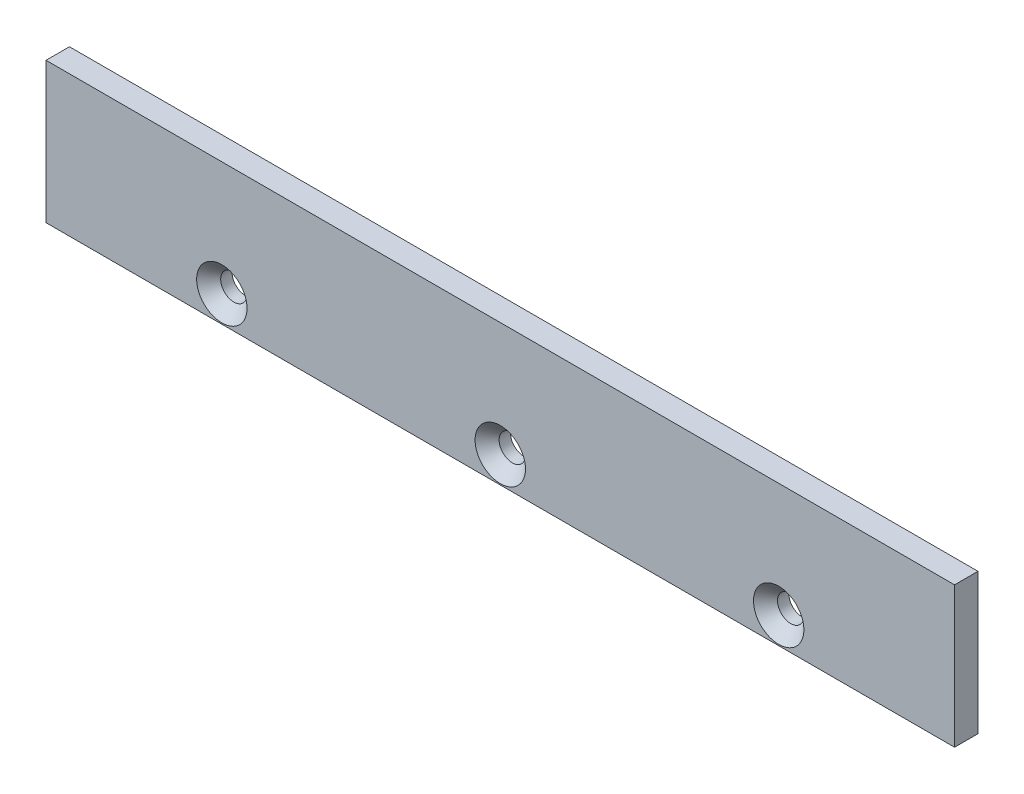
ISO-10303-21;
HEADER;
FILE_DESCRIPTION(('STEP AP214'),'2;1');
FILE_NAME('part.step','',(''),(''),'','','');
FILE_SCHEMA(('AUTOMOTIVE_DESIGN { 1 0 10303 214 1 1 1 1 }'));
ENDSEC;
DATA;
#1=APPLICATION_CONTEXT('core data for automotive mechanical design processes');
#2=APPLICATION_PROTOCOL_DEFINITION('international standard','automotive_design',2000,#1);
#3=PRODUCT_CONTEXT('',#1,'mechanical');
#4=PRODUCT('Part','Part','',(#3));
#5=PRODUCT_RELATED_PRODUCT_CATEGORY('part','',(#4));
#6=PRODUCT_DEFINITION_FORMATION('','',#4);
#7=PRODUCT_DEFINITION_CONTEXT('part definition',#1,'design');
#8=PRODUCT_DEFINITION('design','',#6,#7);
#9=PRODUCT_DEFINITION_SHAPE('','',#8);
#10=(LENGTH_UNIT() NAMED_UNIT(*) SI_UNIT(.MILLI.,.METRE.));
#11=(NAMED_UNIT(*) PLANE_ANGLE_UNIT() SI_UNIT($,.RADIAN.));
#12=(NAMED_UNIT(*) SI_UNIT($,.STERADIAN.) SOLID_ANGLE_UNIT());
#13=UNCERTAINTY_MEASURE_WITH_UNIT(LENGTH_MEASURE(1.E-05),#10,'distance_accuracy_value','');
#14=(GEOMETRIC_REPRESENTATION_CONTEXT(3) GLOBAL_UNCERTAINTY_ASSIGNED_CONTEXT((#13)) GLOBAL_UNIT_ASSIGNED_CONTEXT((#10,
#11,#12)) REPRESENTATION_CONTEXT('',''));
#15=CARTESIAN_POINT('',(0.,0.,0.));
#16=DIRECTION('',(0.,0.,1.));
#17=DIRECTION('',(1.,0.,0.));
#18=AXIS2_PLACEMENT_3D('',#15,#16,#17);
#19=CARTESIAN_POINT('',(-295.384793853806,-18.6706080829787,4.));
#20=DIRECTION('',(1.,0.,0.));
#21=DIRECTION('',(0.,0.,-1.));
#22=AXIS2_PLACEMENT_3D('',#19,#20,#21);
#23=PLANE('',#22);
#24=DIRECTION('',(0.,-1.,0.));
#25=VECTOR('',#24,1.);
#26=CARTESIAN_POINT('',(-295.384793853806,-18.6706080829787,0.));
#27=LINE('',#26,#25);
#28=CARTESIAN_POINT('',(-295.384793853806,5.32939191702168,0.));
#29=VERTEX_POINT('',#28);
#30=CARTESIAN_POINT('',(-295.384793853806,-18.6706080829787,0.));
#31=VERTEX_POINT('',#30);
#32=EDGE_CURVE('E79',#29,#31,#27,.T.);
#33=ORIENTED_EDGE('',*,*,#32,.T.);
#34=DIRECTION('',(0.,0.,-1.));
#35=VECTOR('',#34,1.);
#36=CARTESIAN_POINT('',(-295.384793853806,-18.6706080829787,4.));
#37=LINE('',#36,#35);
#38=CARTESIAN_POINT('',(-295.384793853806,-18.6706080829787,4.));
#39=VERTEX_POINT('',#38);
#40=EDGE_CURVE('E11',#39,#31,#37,.T.);
#41=ORIENTED_EDGE('',*,*,#40,.F.);
#42=DIRECTION('',(0.,-1.,0.));
#43=VECTOR('',#42,1.);
#44=CARTESIAN_POINT('',(-295.384793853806,-18.6706080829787,4.));
#45=LINE('',#44,#43);
#46=CARTESIAN_POINT('',(-295.384793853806,5.32939191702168,4.));
#47=VERTEX_POINT('',#46);
#48=EDGE_CURVE('E67',#47,#39,#45,.T.);
#49=ORIENTED_EDGE('',*,*,#48,.F.);
#50=DIRECTION('',(0.,0.,-1.));
#51=VECTOR('',#50,1.);
#52=CARTESIAN_POINT('',(-295.384793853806,5.32939191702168,4.));
#53=LINE('',#52,#51);
#54=EDGE_CURVE('E75',#47,#29,#53,.T.);
#55=ORIENTED_EDGE('',*,*,#54,.T.);
#56=EDGE_LOOP('',(#33,#41,#49,#55));
#57=FACE_BOUND('',#56,.T.);
#58=ADVANCED_FACE('F16',(#57),#23,.F.);
#59=CARTESIAN_POINT('',(-295.384793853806,-18.6706080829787,4.));
#60=DIRECTION('',(0.,1.,0.));
#61=DIRECTION('',(0.,0.,1.));
#62=AXIS2_PLACEMENT_3D('',#59,#60,#61);
#63=PLANE('',#62);
#64=DIRECTION('',(1.,0.,0.));
#65=VECTOR('',#64,1.);
#66=CARTESIAN_POINT('',(-295.384793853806,-18.6706080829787,0.));
#67=LINE('',#66,#65);
#68=CARTESIAN_POINT('',(-140.384793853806,-18.6706080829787,0.));
#69=VERTEX_POINT('',#68);
#70=EDGE_CURVE('E71',#31,#69,#67,.T.);
#71=ORIENTED_EDGE('',*,*,#70,.T.);
#72=DIRECTION('',(0.,0.,-1.));
#73=VECTOR('',#72,1.);
#74=CARTESIAN_POINT('',(-140.384793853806,-18.6706080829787,4.));
#75=LINE('',#74,#73);
#76=CARTESIAN_POINT('',(-140.384793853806,-18.6706080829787,4.));
#77=VERTEX_POINT('',#76);
#78=EDGE_CURVE('E24',#77,#69,#75,.T.);
#79=ORIENTED_EDGE('',*,*,#78,.F.);
#80=DIRECTION('',(1.,0.,0.));
#81=VECTOR('',#80,1.);
#82=CARTESIAN_POINT('',(-295.384793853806,-18.6706080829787,4.));
#83=LINE('',#82,#81);
#84=EDGE_CURVE('E62',#39,#77,#83,.T.);
#85=ORIENTED_EDGE('',*,*,#84,.F.);
#86=ORIENTED_EDGE('',*,*,#40,.T.);
#87=EDGE_LOOP('',(#71,#79,#85,#86));
#88=FACE_BOUND('',#87,.T.);
#89=ADVANCED_FACE('F70',(#88),#63,.F.);
#90=CARTESIAN_POINT('',(-140.384793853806,-18.6706080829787,4.));
#91=DIRECTION('',(-1.,0.,0.));
#92=DIRECTION('',(0.,0.,1.));
#93=AXIS2_PLACEMENT_3D('',#90,#91,#92);
#94=PLANE('',#93);
#95=DIRECTION('',(0.,1.,0.));
#96=VECTOR('',#95,1.);
#97=CARTESIAN_POINT('',(-140.384793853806,-18.6706080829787,0.));
#98=LINE('',#97,#96);
#99=CARTESIAN_POINT('',(-140.384793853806,5.3293919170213,0.));
#100=VERTEX_POINT('',#99);
#101=EDGE_CURVE('E49',#69,#100,#98,.T.);
#102=ORIENTED_EDGE('',*,*,#101,.T.);
#103=DIRECTION('',(0.,0.,-1.));
#104=VECTOR('',#103,1.);
#105=CARTESIAN_POINT('',(-140.384793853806,5.3293919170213,4.));
#106=LINE('',#105,#104);
#107=CARTESIAN_POINT('',(-140.384793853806,5.3293919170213,4.));
#108=VERTEX_POINT('',#107);
#109=EDGE_CURVE('E72',#108,#100,#106,.T.);
#110=ORIENTED_EDGE('',*,*,#109,.F.);
#111=DIRECTION('',(0.,1.,0.));
#112=VECTOR('',#111,1.);
#113=CARTESIAN_POINT('',(-140.384793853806,-18.6706080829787,4.));
#114=LINE('',#113,#112);
#115=EDGE_CURVE('E65',#77,#108,#114,.T.);
#116=ORIENTED_EDGE('',*,*,#115,.F.);
#117=ORIENTED_EDGE('',*,*,#78,.T.);
#118=EDGE_LOOP('',(#102,#110,#116,#117));
#119=FACE_BOUND('',#118,.T.);
#120=ADVANCED_FACE('F73',(#119),#94,.F.);
#121=CARTESIAN_POINT('',(-295.384793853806,5.32939191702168,4.));
#122=DIRECTION('',(0.,-1.,0.));
#123=DIRECTION('',(1.,0.,0.));
#124=AXIS2_PLACEMENT_3D('',#121,#122,#123);
#125=PLANE('',#124);
#126=DIRECTION('',(-1.,0.,0.));
#127=VECTOR('',#126,1.);
#128=CARTESIAN_POINT('',(-295.384793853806,5.32939191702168,0.));
#129=LINE('',#128,#127);
#130=EDGE_CURVE('E55',#100,#29,#129,.T.);
#131=ORIENTED_EDGE('',*,*,#130,.T.);
#132=ORIENTED_EDGE('',*,*,#54,.F.);
#133=DIRECTION('',(-1.,0.,0.));
#134=VECTOR('',#133,1.);
#135=CARTESIAN_POINT('',(-295.384793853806,5.32939191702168,4.));
#136=LINE('',#135,#134);
#137=EDGE_CURVE('E32',#108,#47,#136,.T.);
#138=ORIENTED_EDGE('',*,*,#137,.F.);
#139=ORIENTED_EDGE('',*,*,#109,.T.);
#140=EDGE_LOOP('',(#131,#132,#138,#139));
#141=FACE_BOUND('',#140,.T.);
#142=ADVANCED_FACE('F87',(#141),#125,.F.);
#143=CARTESIAN_POINT('',(0.,0.,4.));
#144=DIRECTION('',(0.,0.,-1.));
#145=DIRECTION('',(-1.,0.,0.));
#146=AXIS2_PLACEMENT_3D('',#143,#144,#145);
#147=PLANE('',#146);
#148=CARTESIAN_POINT('',(-170.384793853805,-14.1706080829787,4.));
#149=DIRECTION('',(0.,0.,1.));
#150=DIRECTION('',(1.,0.,0.));
#151=AXIS2_PLACEMENT_3D('',#148,#149,#150);
#152=CIRCLE('',#151,4.3);
#153=CARTESIAN_POINT('',(-166.084793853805,-14.1706080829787,4.));
#154=VERTEX_POINT('',#153);
#155=EDGE_CURVE('E116',#154,#154,#152,.T.);
#156=ORIENTED_EDGE('',*,*,#155,.F.);
#157=EDGE_LOOP('',(#156));
#158=FACE_BOUND('',#157,.T.);
#159=CARTESIAN_POINT('',(-217.884793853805,-14.1706080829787,4.));
#160=DIRECTION('',(0.,0.,1.));
#161=DIRECTION('',(1.,0.,0.));
#162=AXIS2_PLACEMENT_3D('',#159,#160,#161);
#163=CIRCLE('',#162,4.3);
#164=CARTESIAN_POINT('',(-213.584793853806,-14.1706080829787,4.));
#165=VERTEX_POINT('',#164);
#166=EDGE_CURVE('E107',#165,#165,#163,.T.);
#167=ORIENTED_EDGE('',*,*,#166,.F.);
#168=EDGE_LOOP('',(#167));
#169=FACE_BOUND('',#168,.T.);
#170=CARTESIAN_POINT('',(-265.384793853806,-14.1706080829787,4.));
#171=DIRECTION('',(0.,0.,1.));
#172=DIRECTION('',(1.,0.,0.));
#173=AXIS2_PLACEMENT_3D('',#170,#171,#172);
#174=CIRCLE('',#173,4.3);
#175=CARTESIAN_POINT('',(-261.084793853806,-14.1706080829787,4.));
#176=VERTEX_POINT('',#175);
#177=EDGE_CURVE('E98',#176,#176,#174,.T.);
#178=ORIENTED_EDGE('',*,*,#177,.F.);
#179=EDGE_LOOP('',(#178));
#180=FACE_BOUND('',#179,.T.);
#181=ORIENTED_EDGE('',*,*,#48,.T.);
#182=ORIENTED_EDGE('',*,*,#84,.T.);
#183=ORIENTED_EDGE('',*,*,#115,.T.);
#184=ORIENTED_EDGE('',*,*,#137,.T.);
#185=EDGE_LOOP('',(#181,#182,#183,#184));
#186=FACE_BOUND('',#185,.T.);
#187=ADVANCED_FACE('F63',(#158,#169,#180,#186),#147,.F.);
#188=CARTESIAN_POINT('',(0.,0.,0.));
#189=DIRECTION('',(0.,0.,-1.));
#190=DIRECTION('',(-1.,0.,0.));
#191=AXIS2_PLACEMENT_3D('',#188,#189,#190);
#192=PLANE('',#191);
#193=CARTESIAN_POINT('',(-170.384793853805,-14.1706080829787,0.));
#194=DIRECTION('',(0.,0.,1.));
#195=DIRECTION('',(1.,0.,0.));
#196=AXIS2_PLACEMENT_3D('',#193,#194,#195);
#197=CIRCLE('',#196,2.25);
#198=CARTESIAN_POINT('',(-168.134793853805,-14.1706080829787,0.));
#199=VERTEX_POINT('',#198);
#200=EDGE_CURVE('E110',#199,#199,#197,.T.);
#201=ORIENTED_EDGE('',*,*,#200,.T.);
#202=EDGE_LOOP('',(#201));
#203=FACE_BOUND('',#202,.T.);
#204=CARTESIAN_POINT('',(-217.884793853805,-14.1706080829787,0.));
#205=DIRECTION('',(0.,0.,1.));
#206=DIRECTION('',(1.,0.,0.));
#207=AXIS2_PLACEMENT_3D('',#204,#205,#206);
#208=CIRCLE('',#207,2.25);
#209=CARTESIAN_POINT('',(-215.634793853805,-14.1706080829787,0.));
#210=VERTEX_POINT('',#209);
#211=EDGE_CURVE('E101',#210,#210,#208,.T.);
#212=ORIENTED_EDGE('',*,*,#211,.T.);
#213=EDGE_LOOP('',(#212));
#214=FACE_BOUND('',#213,.T.);
#215=CARTESIAN_POINT('',(-265.384793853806,-14.1706080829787,0.));
#216=DIRECTION('',(0.,0.,1.));
#217=DIRECTION('',(1.,0.,0.));
#218=AXIS2_PLACEMENT_3D('',#215,#216,#217);
#219=CIRCLE('',#218,2.24999999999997);
#220=CARTESIAN_POINT('',(-263.134793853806,-14.1706080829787,0.));
#221=VERTEX_POINT('',#220);
#222=EDGE_CURVE('E82',#221,#221,#219,.T.);
#223=ORIENTED_EDGE('',*,*,#222,.T.);
#224=EDGE_LOOP('',(#223));
#225=FACE_BOUND('',#224,.T.);
#226=ORIENTED_EDGE('',*,*,#32,.F.);
#227=ORIENTED_EDGE('',*,*,#130,.F.);
#228=ORIENTED_EDGE('',*,*,#101,.F.);
#229=ORIENTED_EDGE('',*,*,#70,.F.);
#230=EDGE_LOOP('',(#226,#227,#228,#229));
#231=FACE_BOUND('',#230,.T.);
#232=ADVANCED_FACE('F90',(#203,#214,#225,#231),#192,.T.);
#233=CARTESIAN_POINT('',(-265.384793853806,-14.1706080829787,4.));
#234=DIRECTION('',(0.,0.,1.));
#235=DIRECTION('',(1.,0.,0.));
#236=AXIS2_PLACEMENT_3D('',#233,#234,#235);
#237=CYLINDRICAL_SURFACE('',#236,2.24999999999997);
#238=ORIENTED_EDGE('',*,*,#222,.F.);
#239=EDGE_LOOP('',(#238));
#240=FACE_BOUND('',#239,.T.);
#241=CARTESIAN_POINT('',(-265.384793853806,-14.1706080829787,1.95));
#242=DIRECTION('',(0.,0.,1.));
#243=DIRECTION('',(1.,0.,0.));
#244=AXIS2_PLACEMENT_3D('',#241,#242,#243);
#245=CIRCLE('',#244,2.24999999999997);
#246=CARTESIAN_POINT('',(-263.134793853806,-14.1706080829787,1.95));
#247=VERTEX_POINT('',#246);
#248=EDGE_CURVE('E95',#247,#247,#245,.T.);
#249=ORIENTED_EDGE('',*,*,#248,.T.);
#250=EDGE_LOOP('',(#249));
#251=FACE_BOUND('',#250,.T.);
#252=ADVANCED_FACE('F132',(#240,#251),#237,.F.);
#253=CARTESIAN_POINT('',(-265.384793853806,-14.1706080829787,4.));
#254=DIRECTION('',(0.,0.,1.));
#255=DIRECTION('',(1.,0.,0.));
#256=AXIS2_PLACEMENT_3D('',#253,#254,#255);
#257=CONICAL_SURFACE('',#256,4.3,0.785398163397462);
#258=ORIENTED_EDGE('',*,*,#248,.F.);
#259=EDGE_LOOP('',(#258));
#260=FACE_BOUND('',#259,.T.);
#261=ORIENTED_EDGE('',*,*,#177,.T.);
#262=EDGE_LOOP('',(#261));
#263=FACE_BOUND('',#262,.T.);
#264=ADVANCED_FACE('F129',(#260,#263),#257,.F.);
#265=CARTESIAN_POINT('',(-217.884793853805,-14.1706080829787,4.));
#266=DIRECTION('',(0.,0.,1.));
#267=DIRECTION('',(1.,0.,0.));
#268=AXIS2_PLACEMENT_3D('',#265,#266,#267);
#269=CYLINDRICAL_SURFACE('',#268,2.25);
#270=ORIENTED_EDGE('',*,*,#211,.F.);
#271=EDGE_LOOP('',(#270));
#272=FACE_BOUND('',#271,.T.);
#273=CARTESIAN_POINT('',(-217.884793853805,-14.1706080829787,1.95));
#274=DIRECTION('',(0.,0.,1.));
#275=DIRECTION('',(1.,0.,0.));
#276=AXIS2_PLACEMENT_3D('',#273,#274,#275);
#277=CIRCLE('',#276,2.24999999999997);
#278=CARTESIAN_POINT('',(-215.634793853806,-14.1706080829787,1.95));
#279=VERTEX_POINT('',#278);
#280=EDGE_CURVE('E104',#279,#279,#277,.T.);
#281=ORIENTED_EDGE('',*,*,#280,.T.);
#282=EDGE_LOOP('',(#281));
#283=FACE_BOUND('',#282,.T.);
#284=ADVANCED_FACE('F131',(#272,#283),#269,.F.);
#285=CARTESIAN_POINT('',(-217.884793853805,-14.1706080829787,4.));
#286=DIRECTION('',(0.,0.,1.));
#287=DIRECTION('',(1.,0.,0.));
#288=AXIS2_PLACEMENT_3D('',#285,#286,#287);
#289=CONICAL_SURFACE('',#288,4.3,0.785398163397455);
#290=ORIENTED_EDGE('',*,*,#280,.F.);
#291=EDGE_LOOP('',(#290));
#292=FACE_BOUND('',#291,.T.);
#293=ORIENTED_EDGE('',*,*,#166,.T.);
#294=EDGE_LOOP('',(#293));
#295=FACE_BOUND('',#294,.T.);
#296=ADVANCED_FACE('F141',(#292,#295),#289,.F.);
#297=CARTESIAN_POINT('',(-170.384793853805,-14.1706080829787,4.));
#298=DIRECTION('',(0.,0.,1.));
#299=DIRECTION('',(1.,0.,0.));
#300=AXIS2_PLACEMENT_3D('',#297,#298,#299);
#301=CYLINDRICAL_SURFACE('',#300,2.25);
#302=ORIENTED_EDGE('',*,*,#200,.F.);
#303=EDGE_LOOP('',(#302));
#304=FACE_BOUND('',#303,.T.);
#305=CARTESIAN_POINT('',(-170.384793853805,-14.1706080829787,1.95));
#306=DIRECTION('',(0.,0.,1.));
#307=DIRECTION('',(1.,0.,0.));
#308=AXIS2_PLACEMENT_3D('',#305,#306,#307);
#309=CIRCLE('',#308,2.24999999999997);
#310=CARTESIAN_POINT('',(-168.134793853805,-14.1706080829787,1.95));
#311=VERTEX_POINT('',#310);
#312=EDGE_CURVE('E113',#311,#311,#309,.T.);
#313=ORIENTED_EDGE('',*,*,#312,.T.);
#314=EDGE_LOOP('',(#313));
#315=FACE_BOUND('',#314,.T.);
#316=ADVANCED_FACE('F176',(#304,#315),#301,.F.);
#317=CARTESIAN_POINT('',(-170.384793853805,-14.1706080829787,4.));
#318=DIRECTION('',(0.,0.,1.));
#319=DIRECTION('',(1.,0.,0.));
#320=AXIS2_PLACEMENT_3D('',#317,#318,#319);
#321=CONICAL_SURFACE('',#320,4.3,0.785398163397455);
#322=ORIENTED_EDGE('',*,*,#312,.F.);
#323=EDGE_LOOP('',(#322));
#324=FACE_BOUND('',#323,.T.);
#325=ORIENTED_EDGE('',*,*,#155,.T.);
#326=EDGE_LOOP('',(#325));
#327=FACE_BOUND('',#326,.T.);
#328=ADVANCED_FACE('F120',(#324,#327),#321,.F.);
#329=CLOSED_SHELL('',(#58,#89,#120,#142,#187,#232,#252,#264,#284,#296,#316,#328));
#330=MANIFOLD_SOLID_BREP('B1',#329);
#331=ADVANCED_BREP_SHAPE_REPRESENTATION('',(#18,#330),#14);
#332=SHAPE_DEFINITION_REPRESENTATION(#9,#331);
ENDSEC;
END-ISO-10303-21;
